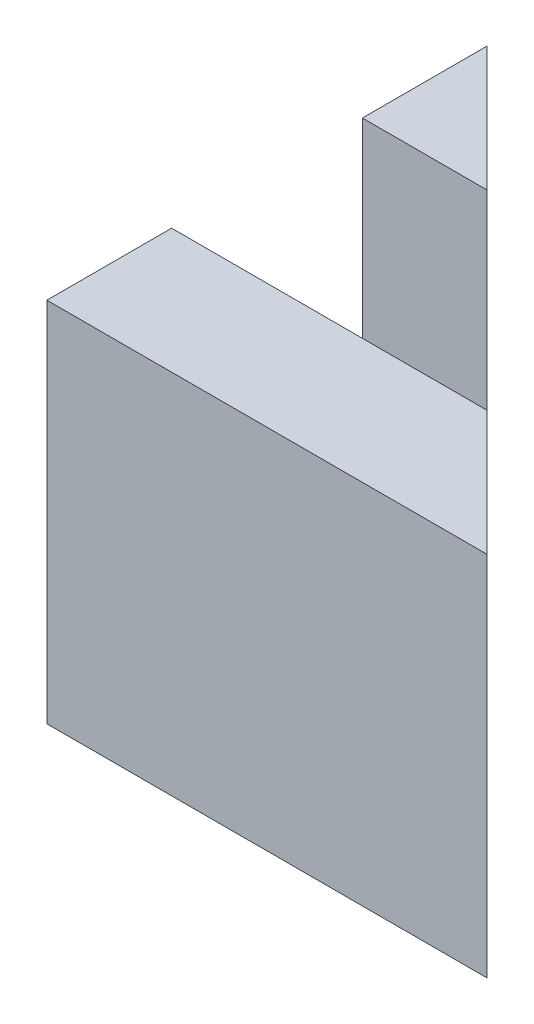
ISO-10303-21;
HEADER;
FILE_DESCRIPTION(('STEP AP214'),'2;1');
FILE_NAME('part.step','',(''),(''),'','','');
FILE_SCHEMA(('AUTOMOTIVE_DESIGN { 1 0 10303 214 1 1 1 1 }'));
ENDSEC;
DATA;
#1=APPLICATION_CONTEXT('core data for automotive mechanical design processes');
#2=APPLICATION_PROTOCOL_DEFINITION('international standard','automotive_design',2000,#1);
#3=PRODUCT_CONTEXT('',#1,'mechanical');
#4=PRODUCT('Part','Part','',(#3));
#5=PRODUCT_RELATED_PRODUCT_CATEGORY('part','',(#4));
#6=PRODUCT_DEFINITION_FORMATION('','',#4);
#7=PRODUCT_DEFINITION_CONTEXT('part definition',#1,'design');
#8=PRODUCT_DEFINITION('design','',#6,#7);
#9=PRODUCT_DEFINITION_SHAPE('','',#8);
#10=(LENGTH_UNIT() NAMED_UNIT(*) SI_UNIT(.MILLI.,.METRE.));
#11=(NAMED_UNIT(*) PLANE_ANGLE_UNIT() SI_UNIT($,.RADIAN.));
#12=(NAMED_UNIT(*) SI_UNIT($,.STERADIAN.) SOLID_ANGLE_UNIT());
#13=UNCERTAINTY_MEASURE_WITH_UNIT(LENGTH_MEASURE(1.E-05),#10,'distance_accuracy_value','');
#14=(GEOMETRIC_REPRESENTATION_CONTEXT(3) GLOBAL_UNCERTAINTY_ASSIGNED_CONTEXT((#13)) GLOBAL_UNIT_ASSIGNED_CONTEXT((#10,
#11,#12)) REPRESENTATION_CONTEXT('',''));
#15=CARTESIAN_POINT('',(0.,0.,0.));
#16=DIRECTION('',(0.,0.,1.));
#17=DIRECTION('',(1.,0.,0.));
#18=AXIS2_PLACEMENT_3D('',#15,#16,#17);
#19=CARTESIAN_POINT('',(0.,9.,-21.5));
#20=DIRECTION('',(-1.,0.,0.));
#21=DIRECTION('',(0.,0.,1.));
#22=AXIS2_PLACEMENT_3D('',#19,#20,#21);
#23=PLANE('',#22);
#24=DIRECTION('',(0.,1.,0.));
#25=VECTOR('',#24,1.);
#26=CARTESIAN_POINT('',(0.,9.,-27.9763480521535));
#27=LINE('',#26,#25);
#28=CARTESIAN_POINT('',(0.,9.52365194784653,-27.9763480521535));
#29=VERTEX_POINT('',#28);
#30=CARTESIAN_POINT('',(0.,15.4763480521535,-27.9763480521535));
#31=VERTEX_POINT('',#30);
#32=EDGE_CURVE('E461',#29,#31,#27,.T.);
#33=ORIENTED_EDGE('',*,*,#32,.T.);
#34=DIRECTION('',(0.,0.,1.));
#35=VECTOR('',#34,1.);
#36=CARTESIAN_POINT('',(0.,15.4763480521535,-21.5));
#37=LINE('',#36,#35);
#38=CARTESIAN_POINT('',(0.,15.4763480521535,-23.5236519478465));
#39=VERTEX_POINT('',#38);
#40=EDGE_CURVE('E444',#31,#39,#37,.T.);
#41=ORIENTED_EDGE('',*,*,#40,.T.);
#42=DIRECTION('',(0.,-1.,0.));
#43=VECTOR('',#42,1.);
#44=CARTESIAN_POINT('',(0.,9.,-23.5236519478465));
#45=LINE('',#44,#43);
#46=CARTESIAN_POINT('',(0.,9.52365194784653,-23.5236519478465));
#47=VERTEX_POINT('',#46);
#48=EDGE_CURVE('E468',#39,#47,#45,.T.);
#49=ORIENTED_EDGE('',*,*,#48,.T.);
#50=DIRECTION('',(0.,0.,-1.));
#51=VECTOR('',#50,1.);
#52=CARTESIAN_POINT('',(0.,9.52365194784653,-21.5));
#53=LINE('',#52,#51);
#54=EDGE_CURVE('E471',#47,#29,#53,.T.);
#55=ORIENTED_EDGE('',*,*,#54,.T.);
#56=EDGE_LOOP('',(#33,#41,#49,#55));
#57=FACE_BOUND('',#56,.T.);
#58=DIRECTION('',(0.,1.,0.));
#59=VECTOR('',#58,1.);
#60=CARTESIAN_POINT('',(0.,9.,-20.9763480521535));
#61=LINE('',#60,#59);
#62=CARTESIAN_POINT('',(0.,2.02365194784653,-20.9763480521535));
#63=VERTEX_POINT('',#62);
#64=CARTESIAN_POINT('',(0.,6.97634805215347,-20.9763480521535));
#65=VERTEX_POINT('',#64);
#66=EDGE_CURVE('E423',#63,#65,#61,.T.);
#67=ORIENTED_EDGE('',*,*,#66,.T.);
#68=DIRECTION('',(0.,0.,1.));
#69=VECTOR('',#68,1.);
#70=CARTESIAN_POINT('',(0.,6.97634805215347,-21.5));
#71=LINE('',#70,#69);
#72=CARTESIAN_POINT('',(0.,6.97634805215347,-16.2736519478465));
#73=VERTEX_POINT('',#72);
#74=EDGE_CURVE('E318',#65,#73,#71,.T.);
#75=ORIENTED_EDGE('',*,*,#74,.T.);
#76=DIRECTION('',(0.,-1.,0.));
#77=VECTOR('',#76,1.);
#78=CARTESIAN_POINT('',(0.,8.99999999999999,-16.2736519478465));
#79=LINE('',#78,#77);
#80=CARTESIAN_POINT('',(0.,2.02365194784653,-16.2736519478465));
#81=VERTEX_POINT('',#80);
#82=EDGE_CURVE('E430',#73,#81,#79,.T.);
#83=ORIENTED_EDGE('',*,*,#82,.T.);
#84=DIRECTION('',(0.,0.,-1.));
#85=VECTOR('',#84,1.);
#86=CARTESIAN_POINT('',(0.,2.02365194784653,-21.5));
#87=LINE('',#86,#85);
#88=EDGE_CURVE('E433',#81,#63,#87,.T.);
#89=ORIENTED_EDGE('',*,*,#88,.T.);
#90=EDGE_LOOP('',(#67,#75,#83,#89));
#91=FACE_BOUND('',#90,.T.);
#92=DIRECTION('',(0.,-1.,0.));
#93=VECTOR('',#92,1.);
#94=CARTESIAN_POINT('',(0.,9.00000000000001,-2.02365194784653));
#95=LINE('',#94,#93);
#96=CARTESIAN_POINT('',(0.,22.9763480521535,-2.02365194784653));
#97=VERTEX_POINT('',#96);
#98=CARTESIAN_POINT('',(0.,18.0236519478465,-2.02365194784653));
#99=VERTEX_POINT('',#98);
#100=EDGE_CURVE('E388',#97,#99,#95,.T.);
#101=ORIENTED_EDGE('',*,*,#100,.T.);
#102=DIRECTION('',(0.,0.,-1.));
#103=VECTOR('',#102,1.);
#104=CARTESIAN_POINT('',(0.,18.0236519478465,-21.5));
#105=LINE('',#104,#103);
#106=CARTESIAN_POINT('',(0.,18.0236519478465,-6.47634805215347));
#107=VERTEX_POINT('',#106);
#108=EDGE_CURVE('E362',#99,#107,#105,.T.);
#109=ORIENTED_EDGE('',*,*,#108,.T.);
#110=DIRECTION('',(0.,1.,0.));
#111=VECTOR('',#110,1.);
#112=CARTESIAN_POINT('',(0.,9.,-6.47634805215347));
#113=LINE('',#112,#111);
#114=CARTESIAN_POINT('',(0.,22.9763480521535,-6.47634805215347));
#115=VERTEX_POINT('',#114);
#116=EDGE_CURVE('E393',#107,#115,#113,.T.);
#117=ORIENTED_EDGE('',*,*,#116,.T.);
#118=DIRECTION('',(0.,0.,1.));
#119=VECTOR('',#118,1.);
#120=CARTESIAN_POINT('',(0.,22.9763480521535,-21.5));
#121=LINE('',#120,#119);
#122=EDGE_CURVE('E390',#115,#97,#121,.T.);
#123=ORIENTED_EDGE('',*,*,#122,.T.);
#124=EDGE_LOOP('',(#101,#109,#117,#123));
#125=FACE_BOUND('',#124,.T.);
#126=DIRECTION('',(0.,0.,1.));
#127=VECTOR('',#126,1.);
#128=CARTESIAN_POINT('',(0.,6.97634805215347,-21.5));
#129=LINE('',#128,#127);
#130=CARTESIAN_POINT('',(0.,6.97634805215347,-13.7263480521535));
#131=VERTEX_POINT('',#130);
#132=CARTESIAN_POINT('',(0.,6.97634805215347,-9.02365194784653));
#133=VERTEX_POINT('',#132);
#134=EDGE_CURVE('E405',#131,#133,#129,.T.);
#135=ORIENTED_EDGE('',*,*,#134,.T.);
#136=DIRECTION('',(0.,-1.,0.));
#137=VECTOR('',#136,1.);
#138=CARTESIAN_POINT('',(0.,9.,-9.02365194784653));
#139=LINE('',#138,#137);
#140=CARTESIAN_POINT('',(0.,2.02365194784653,-9.02365194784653));
#141=VERTEX_POINT('',#140);
#142=EDGE_CURVE('E346',#133,#141,#139,.T.);
#143=ORIENTED_EDGE('',*,*,#142,.T.);
#144=DIRECTION('',(0.,0.,-1.));
#145=VECTOR('',#144,1.);
#146=CARTESIAN_POINT('',(0.,2.02365194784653,-21.5));
#147=LINE('',#146,#145);
#148=CARTESIAN_POINT('',(0.,2.02365194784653,-13.7263480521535));
#149=VERTEX_POINT('',#148);
#150=EDGE_CURVE('E415',#141,#149,#147,.T.);
#151=ORIENTED_EDGE('',*,*,#150,.T.);
#152=DIRECTION('',(0.,1.,0.));
#153=VECTOR('',#152,1.);
#154=CARTESIAN_POINT('',(0.,9.,-13.7263480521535));
#155=LINE('',#154,#153);
#156=EDGE_CURVE('E412',#149,#131,#155,.T.);
#157=ORIENTED_EDGE('',*,*,#156,.T.);
#158=EDGE_LOOP('',(#135,#143,#151,#157));
#159=FACE_BOUND('',#158,.T.);
#160=DIRECTION('',(0.,-1.,0.));
#161=VECTOR('',#160,1.);
#162=CARTESIAN_POINT('',(0.,9.,-21.5));
#163=LINE('',#162,#161);
#164=CARTESIAN_POINT('',(0.,25.,-21.5));
#165=VERTEX_POINT('',#164);
#166=CARTESIAN_POINT('',(0.,9.,-21.5));
#167=VERTEX_POINT('',#166);
#168=EDGE_CURVE('E408',#165,#167,#163,.T.);
#169=ORIENTED_EDGE('',*,*,#168,.F.);
#170=DIRECTION('',(0.,0.,1.));
#171=VECTOR('',#170,1.);
#172=CARTESIAN_POINT('',(0.,25.,-21.5));
#173=LINE('',#172,#171);
#174=CARTESIAN_POINT('',(0.,25.,-30.));
#175=VERTEX_POINT('',#174);
#176=EDGE_CURVE('E298',#175,#165,#173,.T.);
#177=ORIENTED_EDGE('',*,*,#176,.F.);
#178=DIRECTION('',(0.,1.,0.));
#179=VECTOR('',#178,1.);
#180=CARTESIAN_POINT('',(0.,25.,-30.));
#181=LINE('',#180,#179);
#182=CARTESIAN_POINT('',(0.,0.,-30.));
#183=VERTEX_POINT('',#182);
#184=EDGE_CURVE('E281',#183,#175,#181,.T.);
#185=ORIENTED_EDGE('',*,*,#184,.F.);
#186=DIRECTION('',(0.,0.,-1.));
#187=VECTOR('',#186,1.);
#188=CARTESIAN_POINT('',(0.,0.,0.));
#189=LINE('',#188,#187);
#190=CARTESIAN_POINT('',(0.,0.,0.));
#191=VERTEX_POINT('',#190);
#192=EDGE_CURVE('E569',#191,#183,#189,.T.);
#193=ORIENTED_EDGE('',*,*,#192,.F.);
#194=DIRECTION('',(0.,-1.,0.));
#195=VECTOR('',#194,1.);
#196=CARTESIAN_POINT('',(0.,25.,0.));
#197=LINE('',#196,#195);
#198=CARTESIAN_POINT('',(0.,25.,0.));
#199=VERTEX_POINT('',#198);
#200=EDGE_CURVE('E567',#199,#191,#197,.T.);
#201=ORIENTED_EDGE('',*,*,#200,.F.);
#202=DIRECTION('',(0.,0.,1.));
#203=VECTOR('',#202,1.);
#204=CARTESIAN_POINT('',(0.,25.,-8.5));
#205=LINE('',#204,#203);
#206=CARTESIAN_POINT('',(0.,25.,-8.5));
#207=VERTEX_POINT('',#206);
#208=EDGE_CURVE('E565',#207,#199,#205,.T.);
#209=ORIENTED_EDGE('',*,*,#208,.F.);
#210=DIRECTION('',(0.,1.,0.));
#211=VECTOR('',#210,1.);
#212=CARTESIAN_POINT('',(0.,9.,-8.5));
#213=LINE('',#212,#211);
#214=CARTESIAN_POINT('',(0.,9.,-8.5));
#215=VERTEX_POINT('',#214);
#216=EDGE_CURVE('E562',#215,#207,#213,.T.);
#217=ORIENTED_EDGE('',*,*,#216,.F.);
#218=DIRECTION('',(0.,0.,1.));
#219=VECTOR('',#218,1.);
#220=CARTESIAN_POINT('',(0.,9.,-8.5));
#221=LINE('',#220,#219);
#222=EDGE_CURVE('E559',#167,#215,#221,.T.);
#223=ORIENTED_EDGE('',*,*,#222,.F.);
#224=EDGE_LOOP('',(#169,#177,#185,#193,#201,#209,#217,#223));
#225=FACE_BOUND('',#224,.T.);
#226=DIRECTION('',(0.,0.,1.));
#227=VECTOR('',#226,1.);
#228=CARTESIAN_POINT('',(0.,6.97634805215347,-21.5));
#229=LINE('',#228,#227);
#230=CARTESIAN_POINT('',(0.,6.97634805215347,-6.47634805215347));
#231=VERTEX_POINT('',#230);
#232=CARTESIAN_POINT('',(0.,6.97634805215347,-2.02365194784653));
#233=VERTEX_POINT('',#232);
#234=EDGE_CURVE('E343',#231,#233,#229,.T.);
#235=ORIENTED_EDGE('',*,*,#234,.T.);
#236=DIRECTION('',(0.,-1.,0.));
#237=VECTOR('',#236,1.);
#238=CARTESIAN_POINT('',(0.,9.,-2.02365194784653));
#239=LINE('',#238,#237);
#240=CARTESIAN_POINT('',(0.,2.02365194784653,-2.02365194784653));
#241=VERTEX_POINT('',#240);
#242=EDGE_CURVE('E351',#233,#241,#239,.T.);
#243=ORIENTED_EDGE('',*,*,#242,.T.);
#244=DIRECTION('',(0.,0.,-1.));
#245=VECTOR('',#244,1.);
#246=CARTESIAN_POINT('',(0.,2.02365194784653,-21.5));
#247=LINE('',#246,#245);
#248=CARTESIAN_POINT('',(0.,2.02365194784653,-6.47634805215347));
#249=VERTEX_POINT('',#248);
#250=EDGE_CURVE('E354',#241,#249,#247,.T.);
#251=ORIENTED_EDGE('',*,*,#250,.T.);
#252=DIRECTION('',(0.,1.,0.));
#253=VECTOR('',#252,1.);
#254=CARTESIAN_POINT('',(0.,9.,-6.47634805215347));
#255=LINE('',#254,#253);
#256=EDGE_CURVE('E350',#249,#231,#255,.T.);
#257=ORIENTED_EDGE('',*,*,#256,.T.);
#258=EDGE_LOOP('',(#235,#243,#251,#257));
#259=FACE_BOUND('',#258,.T.);
#260=DIRECTION('',(0.,0.,-1.));
#261=VECTOR('',#260,1.);
#262=CARTESIAN_POINT('',(0.,9.52365194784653,-21.5));
#263=LINE('',#262,#261);
#264=CARTESIAN_POINT('',(0.,9.52365194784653,-2.02365194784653));
#265=VERTEX_POINT('',#264);
#266=CARTESIAN_POINT('',(0.,9.52365194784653,-6.47634805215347));
#267=VERTEX_POINT('',#266);
#268=EDGE_CURVE('E369',#265,#267,#263,.T.);
#269=ORIENTED_EDGE('',*,*,#268,.T.);
#270=DIRECTION('',(0.,1.,0.));
#271=VECTOR('',#270,1.);
#272=CARTESIAN_POINT('',(0.,9.,-6.47634805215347));
#273=LINE('',#272,#271);
#274=CARTESIAN_POINT('',(0.,15.4763480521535,-6.47634805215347));
#275=VERTEX_POINT('',#274);
#276=EDGE_CURVE('E374',#267,#275,#273,.T.);
#277=ORIENTED_EDGE('',*,*,#276,.T.);
#278=DIRECTION('',(0.,0.,1.));
#279=VECTOR('',#278,1.);
#280=CARTESIAN_POINT('',(0.,15.4763480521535,-21.5));
#281=LINE('',#280,#279);
#282=CARTESIAN_POINT('',(0.,15.4763480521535,-2.02365194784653));
#283=VERTEX_POINT('',#282);
#284=EDGE_CURVE('E370',#275,#283,#281,.T.);
#285=ORIENTED_EDGE('',*,*,#284,.T.);
#286=DIRECTION('',(0.,-1.,0.));
#287=VECTOR('',#286,1.);
#288=CARTESIAN_POINT('',(0.,9.,-2.02365194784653));
#289=LINE('',#288,#287);
#290=EDGE_CURVE('E373',#283,#265,#289,.T.);
#291=ORIENTED_EDGE('',*,*,#290,.T.);
#292=EDGE_LOOP('',(#269,#277,#285,#291));
#293=FACE_BOUND('',#292,.T.);
#294=DIRECTION('',(0.,0.,-1.));
#295=VECTOR('',#294,1.);
#296=CARTESIAN_POINT('',(0.,18.0236519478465,-21.5));
#297=LINE('',#296,#295);
#298=CARTESIAN_POINT('',(0.,18.0236519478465,-23.5236519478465));
#299=VERTEX_POINT('',#298);
#300=CARTESIAN_POINT('',(0.,18.0236519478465,-27.9763480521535));
#301=VERTEX_POINT('',#300);
#302=EDGE_CURVE('E325',#299,#301,#297,.T.);
#303=ORIENTED_EDGE('',*,*,#302,.T.);
#304=DIRECTION('',(0.,1.,0.));
#305=VECTOR('',#304,1.);
#306=CARTESIAN_POINT('',(0.,8.99999999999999,-27.9763480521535));
#307=LINE('',#306,#305);
#308=CARTESIAN_POINT('',(0.,22.9763480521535,-27.9763480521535));
#309=VERTEX_POINT('',#308);
#310=EDGE_CURVE('E330',#301,#309,#307,.T.);
#311=ORIENTED_EDGE('',*,*,#310,.T.);
#312=DIRECTION('',(0.,0.,1.));
#313=VECTOR('',#312,1.);
#314=CARTESIAN_POINT('',(0.,22.9763480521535,-21.5));
#315=LINE('',#314,#313);
#316=CARTESIAN_POINT('',(0.,22.9763480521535,-23.5236519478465));
#317=VERTEX_POINT('',#316);
#318=EDGE_CURVE('E326',#309,#317,#315,.T.);
#319=ORIENTED_EDGE('',*,*,#318,.T.);
#320=DIRECTION('',(0.,-1.,0.));
#321=VECTOR('',#320,1.);
#322=CARTESIAN_POINT('',(0.,9.,-23.5236519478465));
#323=LINE('',#322,#321);
#324=EDGE_CURVE('E329',#317,#299,#323,.T.);
#325=ORIENTED_EDGE('',*,*,#324,.T.);
#326=EDGE_LOOP('',(#303,#311,#319,#325));
#327=FACE_BOUND('',#326,.T.);
#328=DIRECTION('',(0.,1.,0.));
#329=VECTOR('',#328,1.);
#330=CARTESIAN_POINT('',(0.,9.00000000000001,-27.9763480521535));
#331=LINE('',#330,#329);
#332=CARTESIAN_POINT('',(0.,2.02365194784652,-27.9763480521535));
#333=VERTEX_POINT('',#332);
#334=CARTESIAN_POINT('',(0.,6.97634805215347,-27.9763480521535));
#335=VERTEX_POINT('',#334);
#336=EDGE_CURVE('E441',#333,#335,#331,.T.);
#337=ORIENTED_EDGE('',*,*,#336,.T.);
#338=DIRECTION('',(0.,0.,1.));
#339=VECTOR('',#338,1.);
#340=CARTESIAN_POINT('',(0.,6.97634805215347,-21.5));
#341=LINE('',#340,#339);
#342=CARTESIAN_POINT('',(0.,6.97634805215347,-23.5236519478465));
#343=VERTEX_POINT('',#342);
#344=EDGE_CURVE('E294',#335,#343,#341,.T.);
#345=ORIENTED_EDGE('',*,*,#344,.T.);
#346=DIRECTION('',(0.,-1.,0.));
#347=VECTOR('',#346,1.);
#348=CARTESIAN_POINT('',(0.,9.,-23.5236519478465));
#349=LINE('',#348,#347);
#350=CARTESIAN_POINT('',(0.,2.02365194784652,-23.5236519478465));
#351=VERTEX_POINT('',#350);
#352=EDGE_CURVE('E450',#343,#351,#349,.T.);
#353=ORIENTED_EDGE('',*,*,#352,.T.);
#354=DIRECTION('',(0.,0.,-1.));
#355=VECTOR('',#354,1.);
#356=CARTESIAN_POINT('',(0.,2.02365194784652,-21.5));
#357=LINE('',#356,#355);
#358=EDGE_CURVE('E453',#351,#333,#357,.T.);
#359=ORIENTED_EDGE('',*,*,#358,.T.);
#360=EDGE_LOOP('',(#337,#345,#353,#359));
#361=FACE_BOUND('',#360,.T.);
#362=ADVANCED_FACE('F26',(#57,#91,#125,#159,#225,#259,#293,#327,#361),#23,.T.);
#363=CARTESIAN_POINT('',(30.,9.,-21.5));
#364=DIRECTION('',(0.,0.,-1.));
#365=DIRECTION('',(0.,1.,0.));
#366=AXIS2_PLACEMENT_3D('',#363,#364,#365);
#367=PLANE('',#366);
#368=DIRECTION('',(-1.,0.,0.));
#369=VECTOR('',#368,1.);
#370=CARTESIAN_POINT('',(30.,9.,-21.5));
#371=LINE('',#370,#369);
#372=CARTESIAN_POINT('',(8.50000000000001,9.,-21.5));
#373=VERTEX_POINT('',#372);
#374=EDGE_CURVE('E34',#373,#167,#371,.T.);
#375=ORIENTED_EDGE('',*,*,#374,.F.);
#376=DIRECTION('',(0.,1.,0.));
#377=VECTOR('',#376,1.);
#378=CARTESIAN_POINT('',(8.50000000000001,9.,-21.5));
#379=LINE('',#378,#377);
#380=CARTESIAN_POINT('',(8.50000000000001,25.,-21.5));
#381=VERTEX_POINT('',#380);
#382=EDGE_CURVE('E278',#373,#381,#379,.T.);
#383=ORIENTED_EDGE('',*,*,#382,.T.);
#384=DIRECTION('',(-1.,0.,0.));
#385=VECTOR('',#384,1.);
#386=CARTESIAN_POINT('',(30.,25.,-21.5));
#387=LINE('',#386,#385);
#388=EDGE_CURVE('E293',#381,#165,#387,.T.);
#389=ORIENTED_EDGE('',*,*,#388,.T.);
#390=ORIENTED_EDGE('',*,*,#168,.T.);
#391=EDGE_LOOP('',(#375,#383,#389,#390));
#392=FACE_BOUND('',#391,.T.);
#393=ADVANCED_FACE('F291',(#392),#367,.F.);
#394=CARTESIAN_POINT('',(30.,9.,-8.5));
#395=DIRECTION('',(0.,-1.,0.));
#396=DIRECTION('',(0.,0.,-1.));
#397=AXIS2_PLACEMENT_3D('',#394,#395,#396);
#398=PLANE('',#397);
#399=DIRECTION('',(-1.,0.,0.));
#400=VECTOR('',#399,1.);
#401=CARTESIAN_POINT('',(30.,9.,-8.5));
#402=LINE('',#401,#400);
#403=CARTESIAN_POINT('',(21.5,9.,-8.5));
#404=VERTEX_POINT('',#403);
#405=EDGE_CURVE('E313',#404,#215,#402,.T.);
#406=ORIENTED_EDGE('',*,*,#405,.F.);
#407=DIRECTION('',(-0.707106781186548,0.,-0.707106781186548));
#408=VECTOR('',#407,1.);
#409=CARTESIAN_POINT('',(25.75,9.,-4.25000000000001));
#410=LINE('',#409,#408);
#411=EDGE_CURVE('E295',#404,#373,#410,.T.);
#412=ORIENTED_EDGE('',*,*,#411,.T.);
#413=ORIENTED_EDGE('',*,*,#374,.T.);
#414=ORIENTED_EDGE('',*,*,#222,.T.);
#415=EDGE_LOOP('',(#406,#412,#413,#414));
#416=FACE_BOUND('',#415,.T.);
#417=ADVANCED_FACE('F585',(#416),#398,.F.);
#418=CARTESIAN_POINT('',(30.,9.,-8.5));
#419=DIRECTION('',(0.,0.,1.));
#420=DIRECTION('',(1.,0.,0.));
#421=AXIS2_PLACEMENT_3D('',#418,#419,#420);
#422=PLANE('',#421);
#423=DIRECTION('',(-1.,0.,0.));
#424=VECTOR('',#423,1.);
#425=CARTESIAN_POINT('',(30.,25.,-8.5));
#426=LINE('',#425,#424);
#427=CARTESIAN_POINT('',(21.5,25.,-8.50000000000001));
#428=VERTEX_POINT('',#427);
#429=EDGE_CURVE('E311',#428,#207,#426,.T.);
#430=ORIENTED_EDGE('',*,*,#429,.F.);
#431=DIRECTION('',(0.,-1.,0.));
#432=VECTOR('',#431,1.);
#433=CARTESIAN_POINT('',(21.5,9.,-8.5));
#434=LINE('',#433,#432);
#435=EDGE_CURVE('E554',#428,#404,#434,.T.);
#436=ORIENTED_EDGE('',*,*,#435,.T.);
#437=ORIENTED_EDGE('',*,*,#405,.T.);
#438=ORIENTED_EDGE('',*,*,#216,.T.);
#439=EDGE_LOOP('',(#430,#436,#437,#438));
#440=FACE_BOUND('',#439,.T.);
#441=ADVANCED_FACE('F589',(#440),#422,.F.);
#442=CARTESIAN_POINT('',(30.,25.,-8.5));
#443=DIRECTION('',(0.,-1.,0.));
#444=DIRECTION('',(0.,0.,-1.));
#445=AXIS2_PLACEMENT_3D('',#442,#443,#444);
#446=PLANE('',#445);
#447=DIRECTION('',(-1.,0.,0.));
#448=VECTOR('',#447,1.);
#449=CARTESIAN_POINT('',(30.,25.,0.));
#450=LINE('',#449,#448);
#451=CARTESIAN_POINT('',(30.,25.,0.));
#452=VERTEX_POINT('',#451);
#453=EDGE_CURVE('E304',#452,#199,#450,.T.);
#454=ORIENTED_EDGE('',*,*,#453,.F.);
#455=DIRECTION('',(0.707106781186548,0.,0.707106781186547));
#456=VECTOR('',#455,1.);
#457=CARTESIAN_POINT('',(-1.37798348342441,25.,-31.3779834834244));
#458=LINE('',#457,#456);
#459=EDGE_CURVE('E287',#428,#452,#458,.T.);
#460=ORIENTED_EDGE('',*,*,#459,.F.);
#461=ORIENTED_EDGE('',*,*,#429,.T.);
#462=ORIENTED_EDGE('',*,*,#208,.T.);
#463=EDGE_LOOP('',(#454,#460,#461,#462));
#464=FACE_BOUND('',#463,.T.);
#465=ADVANCED_FACE('F592',(#464),#446,.F.);
#466=CARTESIAN_POINT('',(30.,25.,0.));
#467=DIRECTION('',(0.,0.,-1.));
#468=DIRECTION('',(-1.,0.,0.));
#469=AXIS2_PLACEMENT_3D('',#466,#467,#468);
#470=PLANE('',#469);
#471=ORIENTED_EDGE('',*,*,#200,.T.);
#472=DIRECTION('',(-1.,0.,0.));
#473=VECTOR('',#472,1.);
#474=CARTESIAN_POINT('',(30.,0.,0.));
#475=LINE('',#474,#473);
#476=CARTESIAN_POINT('',(30.,0.,0.));
#477=VERTEX_POINT('',#476);
#478=EDGE_CURVE('E300',#477,#191,#475,.T.);
#479=ORIENTED_EDGE('',*,*,#478,.F.);
#480=DIRECTION('',(0.,-1.,0.));
#481=VECTOR('',#480,1.);
#482=CARTESIAN_POINT('',(30.,25.,0.));
#483=LINE('',#482,#481);
#484=EDGE_CURVE('E301',#452,#477,#483,.T.);
#485=ORIENTED_EDGE('',*,*,#484,.F.);
#486=ORIENTED_EDGE('',*,*,#453,.T.);
#487=EDGE_LOOP('',(#471,#479,#485,#486));
#488=FACE_BOUND('',#487,.T.);
#489=ADVANCED_FACE('F643',(#488),#470,.F.);
#490=CARTESIAN_POINT('',(30.,0.,0.));
#491=DIRECTION('',(0.,1.,0.));
#492=DIRECTION('',(0.,0.,1.));
#493=AXIS2_PLACEMENT_3D('',#490,#491,#492);
#494=PLANE('',#493);
#495=ORIENTED_EDGE('',*,*,#192,.T.);
#496=DIRECTION('',(0.707106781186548,0.,0.707106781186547));
#497=VECTOR('',#496,1.);
#498=CARTESIAN_POINT('',(-1.37798348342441,0.,-31.3779834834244));
#499=LINE('',#498,#497);
#500=EDGE_CURVE('E286',#183,#477,#499,.T.);
#501=ORIENTED_EDGE('',*,*,#500,.T.);
#502=ORIENTED_EDGE('',*,*,#478,.T.);
#503=EDGE_LOOP('',(#495,#501,#502));
#504=FACE_BOUND('',#503,.T.);
#505=ADVANCED_FACE('F575',(#504),#494,.F.);
#506=CARTESIAN_POINT('',(30.,25.,-21.5));
#507=DIRECTION('',(0.,-1.,0.));
#508=DIRECTION('',(0.,0.,-1.));
#509=AXIS2_PLACEMENT_3D('',#506,#507,#508);
#510=PLANE('',#509);
#511=ORIENTED_EDGE('',*,*,#388,.F.);
#512=EDGE_CURVE('E275',#175,#381,#458,.T.);
#513=ORIENTED_EDGE('',*,*,#512,.F.);
#514=ORIENTED_EDGE('',*,*,#176,.T.);
#515=EDGE_LOOP('',(#511,#513,#514));
#516=FACE_BOUND('',#515,.T.);
#517=ADVANCED_FACE('F297',(#516),#510,.F.);
#518=CARTESIAN_POINT('',(30.,7.5,-8.5));
#519=DIRECTION('',(0.0174524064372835,0.,-0.999847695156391));
#520=DIRECTION('',(-0.999847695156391,0.,-0.0174524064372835));
#521=AXIS2_PLACEMENT_3D('',#518,#519,#520);
#522=PLANE('',#521);
#523=DIRECTION('',(0.,1.,0.));
#524=VECTOR('',#523,1.);
#525=CARTESIAN_POINT('',(21.3489961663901,7.5,-8.65100383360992));
#526=LINE('',#525,#524);
#527=CARTESIAN_POINT('',(21.3489961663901,1.65100383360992,-8.65100383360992));
#528=VERTEX_POINT('',#527);
#529=CARTESIAN_POINT('',(21.3489961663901,7.34899616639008,-8.65100383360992));
#530=VERTEX_POINT('',#529);
#531=EDGE_CURVE('E41',#528,#530,#526,.T.);
#532=ORIENTED_EDGE('',*,*,#531,.F.);
#533=DIRECTION('',(-0.999695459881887,0.0174497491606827,-0.0174497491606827));
#534=VECTOR('',#533,1.);
#535=CARTESIAN_POINT('',(30.,1.5,-8.5));
#536=LINE('',#535,#534);
#537=EDGE_CURVE('E406',#528,#141,#536,.T.);
#538=ORIENTED_EDGE('',*,*,#537,.T.);
#539=ORIENTED_EDGE('',*,*,#142,.F.);
#540=DIRECTION('',(-0.999695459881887,-0.0174497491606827,-0.0174497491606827));
#541=VECTOR('',#540,1.);
#542=CARTESIAN_POINT('',(30.,7.5,-8.5));
#543=LINE('',#542,#541);
#544=EDGE_CURVE('E403',#530,#133,#543,.T.);
#545=ORIENTED_EDGE('',*,*,#544,.F.);
#546=EDGE_LOOP('',(#532,#538,#539,#545));
#547=FACE_BOUND('',#546,.T.);
#548=ADVANCED_FACE('F640',(#547),#522,.T.);
#549=CARTESIAN_POINT('',(30.,1.5,-8.5));
#550=DIRECTION('',(0.0174524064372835,0.999847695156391,0.));
#551=DIRECTION('',(-0.999847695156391,0.0174524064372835,0.));
#552=AXIS2_PLACEMENT_3D('',#549,#550,#551);
#553=PLANE('',#552);
#554=DIRECTION('',(0.707052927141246,-0.0123416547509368,0.707052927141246));
#555=VECTOR('',#554,1.);
#556=CARTESIAN_POINT('',(25.7506473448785,1.57417272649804,-4.24935265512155));
#557=LINE('',#556,#555);
#558=CARTESIAN_POINT('',(15.9944674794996,1.7444674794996,-14.0055325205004));
#559=VERTEX_POINT('',#558);
#560=EDGE_CURVE('E551',#559,#528,#557,.T.);
#561=ORIENTED_EDGE('',*,*,#560,.F.);
#562=DIRECTION('',(-0.999695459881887,0.0174497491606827,0.0174497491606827));
#563=VECTOR('',#562,1.);
#564=CARTESIAN_POINT('',(29.8953333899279,1.50182696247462,-14.2481730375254));
#565=LINE('',#564,#563);
#566=EDGE_CURVE('E402',#559,#149,#565,.T.);
#567=ORIENTED_EDGE('',*,*,#566,.T.);
#568=ORIENTED_EDGE('',*,*,#150,.F.);
#569=ORIENTED_EDGE('',*,*,#537,.F.);
#570=EDGE_LOOP('',(#561,#567,#568,#569));
#571=FACE_BOUND('',#570,.T.);
#572=ADVANCED_FACE('F691',(#571),#553,.T.);
#573=CARTESIAN_POINT('',(30.,7.5,-14.25));
#574=DIRECTION('',(0.0174524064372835,0.,0.999847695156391));
#575=DIRECTION('',(0.999847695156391,0.,-0.0174524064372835));
#576=AXIS2_PLACEMENT_3D('',#573,#574,#575);
#577=PLANE('',#576);
#578=DIRECTION('',(0.,-1.,0.));
#579=VECTOR('',#578,1.);
#580=CARTESIAN_POINT('',(15.9944674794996,7.49999999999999,-14.0055325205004));
#581=LINE('',#580,#579);
#582=CARTESIAN_POINT('',(15.9944674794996,7.2555325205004,-14.0055325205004));
#583=VERTEX_POINT('',#582);
#584=EDGE_CURVE('E549',#583,#559,#581,.T.);
#585=ORIENTED_EDGE('',*,*,#584,.F.);
#586=DIRECTION('',(-0.999695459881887,-0.0174497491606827,0.0174497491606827));
#587=VECTOR('',#586,1.);
#588=CARTESIAN_POINT('',(29.8996944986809,7.49824916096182,-14.2482491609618));
#589=LINE('',#588,#587);
#590=EDGE_CURVE('E400',#583,#131,#589,.T.);
#591=ORIENTED_EDGE('',*,*,#590,.T.);
#592=ORIENTED_EDGE('',*,*,#156,.F.);
#593=ORIENTED_EDGE('',*,*,#566,.F.);
#594=EDGE_LOOP('',(#585,#591,#592,#593));
#595=FACE_BOUND('',#594,.T.);
#596=ADVANCED_FACE('F687',(#595),#577,.T.);
#597=CARTESIAN_POINT('',(30.,7.5,-8.5));
#598=DIRECTION('',(0.0174524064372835,-0.999847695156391,0.));
#599=DIRECTION('',(0.999847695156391,0.0174524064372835,0.));
#600=AXIS2_PLACEMENT_3D('',#597,#598,#599);
#601=PLANE('',#600);
#602=DIRECTION('',(-0.707052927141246,-0.0123416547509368,-0.707052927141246));
#603=VECTOR('',#602,1.);
#604=CARTESIAN_POINT('',(25.7506473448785,7.42582727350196,-4.24935265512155));
#605=LINE('',#604,#603);
#606=EDGE_CURVE('E547',#530,#583,#605,.T.);
#607=ORIENTED_EDGE('',*,*,#606,.F.);
#608=ORIENTED_EDGE('',*,*,#544,.T.);
#609=ORIENTED_EDGE('',*,*,#134,.F.);
#610=ORIENTED_EDGE('',*,*,#590,.F.);
#611=EDGE_LOOP('',(#607,#608,#609,#610));
#612=FACE_BOUND('',#611,.T.);
#613=ADVANCED_FACE('F690',(#612),#601,.T.);
#614=CARTESIAN_POINT('',(30.,7.5,-1.5));
#615=DIRECTION('',(0.0174524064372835,0.,-0.999847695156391));
#616=DIRECTION('',(-0.999847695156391,0.,-0.0174524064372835));
#617=AXIS2_PLACEMENT_3D('',#614,#615,#616);
#618=PLANE('',#617);
#619=DIRECTION('',(0.,1.,0.));
#620=VECTOR('',#619,1.);
#621=CARTESIAN_POINT('',(28.4733522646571,7.5,-1.52664773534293));
#622=LINE('',#621,#620);
#623=CARTESIAN_POINT('',(28.4733522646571,1.52664773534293,-1.52664773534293));
#624=VERTEX_POINT('',#623);
#625=CARTESIAN_POINT('',(28.4733522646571,7.47335226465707,-1.52664773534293));
#626=VERTEX_POINT('',#625);
#627=EDGE_CURVE('E49',#624,#626,#622,.T.);
#628=ORIENTED_EDGE('',*,*,#627,.F.);
#629=DIRECTION('',(-0.999695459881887,0.0174497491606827,-0.0174497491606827));
#630=VECTOR('',#629,1.);
#631=CARTESIAN_POINT('',(30.,1.5,-1.5));
#632=LINE('',#631,#630);
#633=EDGE_CURVE('E344',#624,#241,#632,.T.);
#634=ORIENTED_EDGE('',*,*,#633,.T.);
#635=ORIENTED_EDGE('',*,*,#242,.F.);
#636=DIRECTION('',(-0.999695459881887,-0.0174497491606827,-0.0174497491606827));
#637=VECTOR('',#636,1.);
#638=CARTESIAN_POINT('',(30.,7.5,-1.5));
#639=LINE('',#638,#637);
#640=EDGE_CURVE('E341',#626,#233,#639,.T.);
#641=ORIENTED_EDGE('',*,*,#640,.F.);
#642=EDGE_LOOP('',(#628,#634,#635,#641));
#643=FACE_BOUND('',#642,.T.);
#644=ADVANCED_FACE('F704',(#643),#618,.T.);
#645=CARTESIAN_POINT('',(30.,1.5,-1.5));
#646=DIRECTION('',(0.0174524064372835,0.999847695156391,0.));
#647=DIRECTION('',(-0.999847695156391,0.0174524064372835,0.));
#648=AXIS2_PLACEMENT_3D('',#645,#646,#647);
#649=PLANE('',#648);
#650=DIRECTION('',(0.707052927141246,-0.0123416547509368,0.707052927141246));
#651=VECTOR('',#650,1.);
#652=CARTESIAN_POINT('',(29.2501142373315,1.51308930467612,-0.749885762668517));
#653=LINE('',#652,#651);
#654=CARTESIAN_POINT('',(23.1200892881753,1.62008928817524,-6.87991071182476));
#655=VERTEX_POINT('',#654);
#656=EDGE_CURVE('E544',#655,#624,#653,.T.);
#657=ORIENTED_EDGE('',*,*,#656,.F.);
#658=DIRECTION('',(-0.999695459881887,0.0174497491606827,0.0174497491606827));
#659=VECTOR('',#658,1.);
#660=CARTESIAN_POINT('',(29.8953333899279,1.50182696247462,-6.99817303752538));
#661=LINE('',#660,#659);
#662=EDGE_CURVE('E340',#655,#249,#661,.T.);
#663=ORIENTED_EDGE('',*,*,#662,.T.);
#664=ORIENTED_EDGE('',*,*,#250,.F.);
#665=ORIENTED_EDGE('',*,*,#633,.F.);
#666=EDGE_LOOP('',(#657,#663,#664,#665));
#667=FACE_BOUND('',#666,.T.);
#668=ADVANCED_FACE('F700',(#667),#649,.T.);
#669=CARTESIAN_POINT('',(30.,7.5,-7.));
#670=DIRECTION('',(0.0174524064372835,0.,0.999847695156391));
#671=DIRECTION('',(0.999847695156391,0.,-0.0174524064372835));
#672=AXIS2_PLACEMENT_3D('',#669,#670,#671);
#673=PLANE('',#672);
#674=DIRECTION('',(0.,-1.,0.));
#675=VECTOR('',#674,1.);
#676=CARTESIAN_POINT('',(23.1200892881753,7.5,-6.87991071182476));
#677=LINE('',#676,#675);
#678=CARTESIAN_POINT('',(23.1200892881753,7.37991071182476,-6.87991071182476));
#679=VERTEX_POINT('',#678);
#680=EDGE_CURVE('E542',#679,#655,#677,.T.);
#681=ORIENTED_EDGE('',*,*,#680,.F.);
#682=DIRECTION('',(-0.999695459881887,-0.0174497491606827,0.0174497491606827));
#683=VECTOR('',#682,1.);
#684=CARTESIAN_POINT('',(29.9040556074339,7.49832528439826,-6.99832528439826));
#685=LINE('',#684,#683);
#686=EDGE_CURVE('E338',#679,#231,#685,.T.);
#687=ORIENTED_EDGE('',*,*,#686,.T.);
#688=ORIENTED_EDGE('',*,*,#256,.F.);
#689=ORIENTED_EDGE('',*,*,#662,.F.);
#690=EDGE_LOOP('',(#681,#687,#688,#689));
#691=FACE_BOUND('',#690,.T.);
#692=ADVANCED_FACE('F696',(#691),#673,.T.);
#693=CARTESIAN_POINT('',(30.,7.5,-1.5));
#694=DIRECTION('',(0.0174524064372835,-0.999847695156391,0.));
#695=DIRECTION('',(0.999847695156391,0.0174524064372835,0.));
#696=AXIS2_PLACEMENT_3D('',#693,#694,#695);
#697=PLANE('',#696);
#698=DIRECTION('',(-0.707052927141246,-0.0123416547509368,-0.707052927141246));
#699=VECTOR('',#698,1.);
#700=CARTESIAN_POINT('',(29.2501142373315,7.48691069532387,-0.749885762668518));
#701=LINE('',#700,#699);
#702=EDGE_CURVE('E540',#626,#679,#701,.T.);
#703=ORIENTED_EDGE('',*,*,#702,.F.);
#704=ORIENTED_EDGE('',*,*,#640,.T.);
#705=ORIENTED_EDGE('',*,*,#234,.F.);
#706=ORIENTED_EDGE('',*,*,#686,.F.);
#707=EDGE_LOOP('',(#703,#704,#705,#706));
#708=FACE_BOUND('',#707,.T.);
#709=ADVANCED_FACE('F699',(#708),#697,.T.);
#710=CARTESIAN_POINT('',(30.,17.5,-1.5));
#711=DIRECTION('',(0.0174524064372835,0.999847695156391,0.));
#712=DIRECTION('',(-0.999847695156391,0.0174524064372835,0.));
#713=AXIS2_PLACEMENT_3D('',#710,#711,#712);
#714=PLANE('',#713);
#715=DIRECTION('',(0.707052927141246,-0.0123416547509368,0.707052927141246));
#716=VECTOR('',#715,1.);
#717=CARTESIAN_POINT('',(29.2501142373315,17.5130893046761,-0.749885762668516));
#718=LINE('',#717,#716);
#719=CARTESIAN_POINT('',(23.1200892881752,17.6200892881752,-6.87991071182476));
#720=VERTEX_POINT('',#719);
#721=CARTESIAN_POINT('',(28.4733522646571,17.5266477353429,-1.52664773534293));
#722=VERTEX_POINT('',#721);
#723=EDGE_CURVE('E538',#720,#722,#718,.T.);
#724=ORIENTED_EDGE('',*,*,#723,.F.);
#725=DIRECTION('',(-0.999695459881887,0.0174497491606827,0.0174497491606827));
#726=VECTOR('',#725,1.);
#727=CARTESIAN_POINT('',(30.,17.5,-7.));
#728=LINE('',#727,#726);
#729=EDGE_CURVE('E355',#720,#107,#728,.T.);
#730=ORIENTED_EDGE('',*,*,#729,.T.);
#731=ORIENTED_EDGE('',*,*,#108,.F.);
#732=DIRECTION('',(-0.999695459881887,0.0174497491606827,-0.0174497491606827));
#733=VECTOR('',#732,1.);
#734=CARTESIAN_POINT('',(30.,17.5,-1.5));
#735=LINE('',#734,#733);
#736=EDGE_CURVE('E386',#722,#99,#735,.T.);
#737=ORIENTED_EDGE('',*,*,#736,.F.);
#738=EDGE_LOOP('',(#724,#730,#731,#737));
#739=FACE_BOUND('',#738,.T.);
#740=ADVANCED_FACE('F28',(#739),#714,.T.);
#741=CARTESIAN_POINT('',(30.,17.5,-7.));
#742=DIRECTION('',(0.0174524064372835,0.,0.999847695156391));
#743=DIRECTION('',(0.999847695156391,0.,-0.0174524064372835));
#744=AXIS2_PLACEMENT_3D('',#741,#742,#743);
#745=PLANE('',#744);
#746=DIRECTION('',(0.,-1.,0.));
#747=VECTOR('',#746,1.);
#748=CARTESIAN_POINT('',(23.1200892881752,17.5,-6.87991071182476));
#749=LINE('',#748,#747);
#750=CARTESIAN_POINT('',(23.1200892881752,23.3799107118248,-6.87991071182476));
#751=VERTEX_POINT('',#750);
#752=EDGE_CURVE('E536',#751,#720,#749,.T.);
#753=ORIENTED_EDGE('',*,*,#752,.F.);
#754=DIRECTION('',(-0.999695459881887,-0.0174497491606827,0.0174497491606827));
#755=VECTOR('',#754,1.);
#756=CARTESIAN_POINT('',(29.9040556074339,23.4983252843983,-6.99832528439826));
#757=LINE('',#756,#755);
#758=EDGE_CURVE('E382',#751,#115,#757,.T.);
#759=ORIENTED_EDGE('',*,*,#758,.T.);
#760=ORIENTED_EDGE('',*,*,#116,.F.);
#761=ORIENTED_EDGE('',*,*,#729,.F.);
#762=EDGE_LOOP('',(#753,#759,#760,#761));
#763=FACE_BOUND('',#762,.T.);
#764=ADVANCED_FACE('F717',(#763),#745,.T.);
#765=CARTESIAN_POINT('',(30.,23.5,-1.5));
#766=DIRECTION('',(0.0174524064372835,-0.999847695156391,0.));
#767=DIRECTION('',(0.999847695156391,0.0174524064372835,0.));
#768=AXIS2_PLACEMENT_3D('',#765,#766,#767);
#769=PLANE('',#768);
#770=DIRECTION('',(-0.707052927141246,-0.0123416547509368,-0.707052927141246));
#771=VECTOR('',#770,1.);
#772=CARTESIAN_POINT('',(29.2501142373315,23.4869106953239,-0.749885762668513));
#773=LINE('',#772,#771);
#774=CARTESIAN_POINT('',(28.4733522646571,23.4733522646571,-1.52664773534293));
#775=VERTEX_POINT('',#774);
#776=EDGE_CURVE('E534',#775,#751,#773,.T.);
#777=ORIENTED_EDGE('',*,*,#776,.F.);
#778=DIRECTION('',(-0.999695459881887,-0.0174497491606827,-0.0174497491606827));
#779=VECTOR('',#778,1.);
#780=CARTESIAN_POINT('',(29.8953333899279,23.4981730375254,-1.50182696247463));
#781=LINE('',#780,#779);
#782=EDGE_CURVE('E384',#775,#97,#781,.T.);
#783=ORIENTED_EDGE('',*,*,#782,.T.);
#784=ORIENTED_EDGE('',*,*,#122,.F.);
#785=ORIENTED_EDGE('',*,*,#758,.F.);
#786=EDGE_LOOP('',(#777,#783,#784,#785));
#787=FACE_BOUND('',#786,.T.);
#788=ADVANCED_FACE('F719',(#787),#769,.T.);
#789=CARTESIAN_POINT('',(30.,17.5,-1.5));
#790=DIRECTION('',(0.0174524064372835,0.,-0.999847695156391));
#791=DIRECTION('',(-0.999847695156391,0.,-0.0174524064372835));
#792=AXIS2_PLACEMENT_3D('',#789,#790,#791);
#793=PLANE('',#792);
#794=DIRECTION('',(0.,1.,0.));
#795=VECTOR('',#794,1.);
#796=CARTESIAN_POINT('',(28.4733522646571,17.5,-1.52664773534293));
#797=LINE('',#796,#795);
#798=EDGE_CURVE('E532',#722,#775,#797,.T.);
#799=ORIENTED_EDGE('',*,*,#798,.F.);
#800=ORIENTED_EDGE('',*,*,#736,.T.);
#801=ORIENTED_EDGE('',*,*,#100,.F.);
#802=ORIENTED_EDGE('',*,*,#782,.F.);
#803=EDGE_LOOP('',(#799,#800,#801,#802));
#804=FACE_BOUND('',#803,.T.);
#805=ADVANCED_FACE('F710',(#804),#793,.T.);
#806=CARTESIAN_POINT('',(30.,16.,-7.));
#807=DIRECTION('',(0.0174524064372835,0.,0.999847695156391));
#808=DIRECTION('',(0.999847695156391,0.,-0.0174524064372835));
#809=AXIS2_PLACEMENT_3D('',#806,#807,#808);
#810=PLANE('',#809);
#811=DIRECTION('',(0.,-1.,0.));
#812=VECTOR('',#811,1.);
#813=CARTESIAN_POINT('',(23.1200892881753,16.,-6.87991071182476));
#814=LINE('',#813,#812);
#815=CARTESIAN_POINT('',(23.1200892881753,15.8799107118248,-6.87991071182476));
#816=VERTEX_POINT('',#815);
#817=CARTESIAN_POINT('',(23.1200892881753,9.12008928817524,-6.87991071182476));
#818=VERTEX_POINT('',#817);
#819=EDGE_CURVE('E530',#816,#818,#814,.T.);
#820=ORIENTED_EDGE('',*,*,#819,.F.);
#821=DIRECTION('',(-0.999695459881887,-0.0174497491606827,0.0174497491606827));
#822=VECTOR('',#821,1.);
#823=CARTESIAN_POINT('',(29.9040556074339,15.9983252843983,-6.99832528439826));
#824=LINE('',#823,#822);
#825=EDGE_CURVE('E360',#816,#275,#824,.T.);
#826=ORIENTED_EDGE('',*,*,#825,.T.);
#827=ORIENTED_EDGE('',*,*,#276,.F.);
#828=DIRECTION('',(-0.999695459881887,0.0174497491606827,0.0174497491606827));
#829=VECTOR('',#828,1.);
#830=CARTESIAN_POINT('',(29.8778889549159,9.0021314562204,-6.99786854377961));
#831=LINE('',#830,#829);
#832=EDGE_CURVE('E367',#818,#267,#831,.T.);
#833=ORIENTED_EDGE('',*,*,#832,.F.);
#834=EDGE_LOOP('',(#820,#826,#827,#833));
#835=FACE_BOUND('',#834,.T.);
#836=ADVANCED_FACE('F706',(#835),#810,.T.);
#837=CARTESIAN_POINT('',(30.,16.,-1.5));
#838=DIRECTION('',(0.0174524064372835,-0.999847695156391,0.));
#839=DIRECTION('',(0.999847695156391,0.0174524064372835,0.));
#840=AXIS2_PLACEMENT_3D('',#837,#838,#839);
#841=PLANE('',#840);
#842=DIRECTION('',(-0.707052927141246,-0.0123416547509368,-0.707052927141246));
#843=VECTOR('',#842,1.);
#844=CARTESIAN_POINT('',(29.2501142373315,15.9869106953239,-0.749885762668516));
#845=LINE('',#844,#843);
#846=CARTESIAN_POINT('',(28.4733522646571,15.9733522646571,-1.52664773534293));
#847=VERTEX_POINT('',#846);
#848=EDGE_CURVE('E528',#847,#816,#845,.T.);
#849=ORIENTED_EDGE('',*,*,#848,.F.);
#850=DIRECTION('',(-0.999695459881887,-0.0174497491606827,-0.0174497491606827));
#851=VECTOR('',#850,1.);
#852=CARTESIAN_POINT('',(30.,16.,-1.5));
#853=LINE('',#852,#851);
#854=EDGE_CURVE('E363',#847,#283,#853,.T.);
#855=ORIENTED_EDGE('',*,*,#854,.T.);
#856=ORIENTED_EDGE('',*,*,#284,.F.);
#857=ORIENTED_EDGE('',*,*,#825,.F.);
#858=EDGE_LOOP('',(#849,#855,#856,#857));
#859=FACE_BOUND('',#858,.T.);
#860=ADVANCED_FACE('F709',(#859),#841,.T.);
#861=CARTESIAN_POINT('',(30.,16.,-1.5));
#862=DIRECTION('',(0.0174524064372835,0.,-0.999847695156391));
#863=DIRECTION('',(-0.999847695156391,0.,-0.0174524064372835));
#864=AXIS2_PLACEMENT_3D('',#861,#862,#863);
#865=PLANE('',#864);
#866=DIRECTION('',(0.,1.,0.));
#867=VECTOR('',#866,1.);
#868=CARTESIAN_POINT('',(28.4733522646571,16.,-1.52664773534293));
#869=LINE('',#868,#867);
#870=CARTESIAN_POINT('',(28.4733522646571,9.02664773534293,-1.52664773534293));
#871=VERTEX_POINT('',#870);
#872=EDGE_CURVE('E526',#871,#847,#869,.T.);
#873=ORIENTED_EDGE('',*,*,#872,.F.);
#874=DIRECTION('',(-0.999695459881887,0.0174497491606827,-0.0174497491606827));
#875=VECTOR('',#874,1.);
#876=CARTESIAN_POINT('',(30.,9.,-1.5));
#877=LINE('',#876,#875);
#878=EDGE_CURVE('E365',#871,#265,#877,.T.);
#879=ORIENTED_EDGE('',*,*,#878,.T.);
#880=ORIENTED_EDGE('',*,*,#290,.F.);
#881=ORIENTED_EDGE('',*,*,#854,.F.);
#882=EDGE_LOOP('',(#873,#879,#880,#881));
#883=FACE_BOUND('',#882,.T.);
#884=ADVANCED_FACE('F715',(#883),#865,.T.);
#885=CARTESIAN_POINT('',(30.,9.,-1.5));
#886=DIRECTION('',(0.0174524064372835,0.999847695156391,0.));
#887=DIRECTION('',(-0.999847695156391,0.0174524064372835,0.));
#888=AXIS2_PLACEMENT_3D('',#885,#886,#887);
#889=PLANE('',#888);
#890=DIRECTION('',(0.707052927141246,-0.0123416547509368,0.707052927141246));
#891=VECTOR('',#890,1.);
#892=CARTESIAN_POINT('',(29.2501142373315,9.01308930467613,-0.749885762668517));
#893=LINE('',#892,#891);
#894=EDGE_CURVE('E524',#818,#871,#893,.T.);
#895=ORIENTED_EDGE('',*,*,#894,.F.);
#896=ORIENTED_EDGE('',*,*,#832,.T.);
#897=ORIENTED_EDGE('',*,*,#268,.F.);
#898=ORIENTED_EDGE('',*,*,#878,.F.);
#899=EDGE_LOOP('',(#895,#896,#897,#898));
#900=FACE_BOUND('',#899,.T.);
#901=ADVANCED_FACE('F712',(#900),#889,.T.);
#902=CARTESIAN_POINT('',(30.,7.5,-21.5));
#903=DIRECTION('',(0.0174524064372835,-0.999847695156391,0.));
#904=DIRECTION('',(0.999847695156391,0.0174524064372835,0.));
#905=AXIS2_PLACEMENT_3D('',#902,#903,#904);
#906=PLANE('',#905);
#907=DIRECTION('',(-0.707052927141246,-0.0123416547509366,-0.707052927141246));
#908=VECTOR('',#907,1.);
#909=CARTESIAN_POINT('',(19.2516374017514,7.31238663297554,-10.7483625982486));
#910=LINE('',#909,#908);
#911=CARTESIAN_POINT('',(13.9701987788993,7.22019877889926,-16.0298012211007));
#912=VERTEX_POINT('',#911);
#913=CARTESIAN_POINT('',(8.86884567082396,7.13115432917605,-21.1311543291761));
#914=VERTEX_POINT('',#913);
#915=EDGE_CURVE('E522',#912,#914,#910,.T.);
#916=ORIENTED_EDGE('',*,*,#915,.F.);
#917=DIRECTION('',(-0.999695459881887,-0.0174497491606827,-0.0174497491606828));
#918=VECTOR('',#917,1.);
#919=CARTESIAN_POINT('',(30.,7.5,-15.75));
#920=LINE('',#919,#918);
#921=EDGE_CURVE('E381',#912,#73,#920,.T.);
#922=ORIENTED_EDGE('',*,*,#921,.T.);
#923=ORIENTED_EDGE('',*,*,#74,.F.);
#924=DIRECTION('',(-0.999695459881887,-0.0174497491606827,0.0174497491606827));
#925=VECTOR('',#924,1.);
#926=CARTESIAN_POINT('',(30.,7.5,-21.5));
#927=LINE('',#926,#925);
#928=EDGE_CURVE('E420',#914,#65,#927,.T.);
#929=ORIENTED_EDGE('',*,*,#928,.F.);
#930=EDGE_LOOP('',(#916,#922,#923,#929));
#931=FACE_BOUND('',#930,.T.);
#932=ADVANCED_FACE('F714',(#931),#906,.T.);
#933=CARTESIAN_POINT('',(30.,7.5,-15.75));
#934=DIRECTION('',(0.0174524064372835,0.,-0.999847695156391));
#935=DIRECTION('',(-0.999847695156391,0.,-0.0174524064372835));
#936=AXIS2_PLACEMENT_3D('',#933,#934,#935);
#937=PLANE('',#936);
#938=DIRECTION('',(0.,1.,0.));
#939=VECTOR('',#938,1.);
#940=CARTESIAN_POINT('',(13.9701987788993,7.50000000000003,-16.0298012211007));
#941=LINE('',#940,#939);
#942=CARTESIAN_POINT('',(13.9701987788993,1.77980122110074,-16.0298012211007));
#943=VERTEX_POINT('',#942);
#944=EDGE_CURVE('E520',#943,#912,#941,.T.);
#945=ORIENTED_EDGE('',*,*,#944,.F.);
#946=DIRECTION('',(-0.999695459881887,0.0174497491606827,-0.0174497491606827));
#947=VECTOR('',#946,1.);
#948=CARTESIAN_POINT('',(29.8996944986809,1.50175083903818,-15.7517508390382));
#949=LINE('',#948,#947);
#950=EDGE_CURVE('E425',#943,#81,#949,.T.);
#951=ORIENTED_EDGE('',*,*,#950,.T.);
#952=ORIENTED_EDGE('',*,*,#82,.F.);
#953=ORIENTED_EDGE('',*,*,#921,.F.);
#954=EDGE_LOOP('',(#945,#951,#952,#953));
#955=FACE_BOUND('',#954,.T.);
#956=ADVANCED_FACE('F685',(#955),#937,.T.);
#957=CARTESIAN_POINT('',(30.,1.5,-21.5));
#958=DIRECTION('',(0.0174524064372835,0.999847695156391,0.));
#959=DIRECTION('',(-0.999847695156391,0.0174524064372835,0.));
#960=AXIS2_PLACEMENT_3D('',#957,#958,#959);
#961=PLANE('',#960);
#962=DIRECTION('',(0.707052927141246,-0.0123416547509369,0.707052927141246));
#963=VECTOR('',#962,1.);
#964=CARTESIAN_POINT('',(19.2516374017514,1.68761336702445,-10.7483625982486));
#965=LINE('',#964,#963);
#966=CARTESIAN_POINT('',(8.86884567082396,1.86884567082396,-21.1311543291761));
#967=VERTEX_POINT('',#966);
#968=EDGE_CURVE('E518',#967,#943,#965,.T.);
#969=ORIENTED_EDGE('',*,*,#968,.F.);
#970=DIRECTION('',(-0.999695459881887,0.0174497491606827,0.0174497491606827));
#971=VECTOR('',#970,1.);
#972=CARTESIAN_POINT('',(29.8953333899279,1.50182696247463,-21.4981730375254));
#973=LINE('',#972,#971);
#974=EDGE_CURVE('E422',#967,#63,#973,.T.);
#975=ORIENTED_EDGE('',*,*,#974,.T.);
#976=ORIENTED_EDGE('',*,*,#88,.F.);
#977=ORIENTED_EDGE('',*,*,#950,.F.);
#978=EDGE_LOOP('',(#969,#975,#976,#977));
#979=FACE_BOUND('',#978,.T.);
#980=ADVANCED_FACE('F681',(#979),#961,.T.);
#981=CARTESIAN_POINT('',(30.,7.5,-21.5));
#982=DIRECTION('',(0.0174524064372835,0.,0.999847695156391));
#983=DIRECTION('',(0.999847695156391,0.,-0.0174524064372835));
#984=AXIS2_PLACEMENT_3D('',#981,#982,#983);
#985=PLANE('',#984);
#986=DIRECTION('',(0.,-1.,0.));
#987=VECTOR('',#986,1.);
#988=CARTESIAN_POINT('',(8.86884567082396,7.50000000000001,-21.1311543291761));
#989=LINE('',#988,#987);
#990=EDGE_CURVE('E516',#914,#967,#989,.T.);
#991=ORIENTED_EDGE('',*,*,#990,.F.);
#992=ORIENTED_EDGE('',*,*,#928,.T.);
#993=ORIENTED_EDGE('',*,*,#66,.F.);
#994=ORIENTED_EDGE('',*,*,#974,.F.);
#995=EDGE_LOOP('',(#991,#992,#993,#994));
#996=FACE_BOUND('',#995,.T.);
#997=ADVANCED_FACE('F678',(#996),#985,.T.);
#998=CARTESIAN_POINT('',(30.,17.5,-28.5));
#999=DIRECTION('',(0.0174524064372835,0.,0.999847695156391));
#1000=DIRECTION('',(0.999847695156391,0.,-0.0174524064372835));
#1001=AXIS2_PLACEMENT_3D('',#998,#999,#1000);
#1002=PLANE('',#1001);
#1003=DIRECTION('',(0.,-1.,0.));
#1004=VECTOR('',#1003,1.);
#1005=CARTESIAN_POINT('',(1.98893495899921,17.4999999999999,-28.0110650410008));
#1006=LINE('',#1005,#1004);
#1007=CARTESIAN_POINT('',(1.9889349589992,23.0110650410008,-28.0110650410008));
#1008=VERTEX_POINT('',#1007);
#1009=CARTESIAN_POINT('',(1.98893495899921,17.9889349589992,-28.0110650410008));
#1010=VERTEX_POINT('',#1009);
#1011=EDGE_CURVE('E514',#1008,#1010,#1006,.T.);
#1012=ORIENTED_EDGE('',*,*,#1011,.F.);
#1013=DIRECTION('',(-0.999695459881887,-0.0174497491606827,0.0174497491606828));
#1014=VECTOR('',#1013,1.);
#1015=CARTESIAN_POINT('',(30.,23.5,-28.5));
#1016=LINE('',#1015,#1014);
#1017=EDGE_CURVE('E316',#1008,#309,#1016,.T.);
#1018=ORIENTED_EDGE('',*,*,#1017,.T.);
#1019=ORIENTED_EDGE('',*,*,#310,.F.);
#1020=DIRECTION('',(-0.999695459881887,0.0174497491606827,0.0174497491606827));
#1021=VECTOR('',#1020,1.);
#1022=CARTESIAN_POINT('',(30.,17.5,-28.5));
#1023=LINE('',#1022,#1021);
#1024=EDGE_CURVE('E323',#1010,#301,#1023,.T.);
#1025=ORIENTED_EDGE('',*,*,#1024,.F.);
#1026=EDGE_LOOP('',(#1012,#1018,#1019,#1025));
#1027=FACE_BOUND('',#1026,.T.);
#1028=ADVANCED_FACE('F657',(#1027),#1002,.T.);
#1029=CARTESIAN_POINT('',(30.,23.5,-28.5));
#1030=DIRECTION('',(0.0174524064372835,-0.999847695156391,0.));
#1031=DIRECTION('',(0.999847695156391,0.0174524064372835,0.));
#1032=AXIS2_PLACEMENT_3D('',#1029,#1030,#1031);
#1033=PLANE('',#1032);
#1034=DIRECTION('',(-0.707052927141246,-0.0123416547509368,-0.707052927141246));
#1035=VECTOR('',#1034,1.);
#1036=CARTESIAN_POINT('',(15.7521705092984,23.2513032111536,-14.2478294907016));
#1037=LINE('',#1036,#1035);
#1038=CARTESIAN_POINT('',(6.59140139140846,23.0914013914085,-23.4085986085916));
#1039=VERTEX_POINT('',#1038);
#1040=EDGE_CURVE('E512',#1039,#1008,#1037,.T.);
#1041=ORIENTED_EDGE('',*,*,#1040,.F.);
#1042=DIRECTION('',(-0.999695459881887,-0.0174497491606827,-0.0174497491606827));
#1043=VECTOR('',#1042,1.);
#1044=CARTESIAN_POINT('',(29.8953333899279,23.4981730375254,-23.0018269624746));
#1045=LINE('',#1044,#1043);
#1046=EDGE_CURVE('E319',#1039,#317,#1045,.T.);
#1047=ORIENTED_EDGE('',*,*,#1046,.T.);
#1048=ORIENTED_EDGE('',*,*,#318,.F.);
#1049=ORIENTED_EDGE('',*,*,#1017,.F.);
#1050=EDGE_LOOP('',(#1041,#1047,#1048,#1049));
#1051=FACE_BOUND('',#1050,.T.);
#1052=ADVANCED_FACE('F653',(#1051),#1033,.T.);
#1053=CARTESIAN_POINT('',(30.,17.5,-23.));
#1054=DIRECTION('',(0.0174524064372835,0.,-0.999847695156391));
#1055=DIRECTION('',(-0.999847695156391,0.,-0.0174524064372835));
#1056=AXIS2_PLACEMENT_3D('',#1053,#1054,#1055);
#1057=PLANE('',#1056);
#1058=DIRECTION('',(0.,1.,0.));
#1059=VECTOR('',#1058,1.);
#1060=CARTESIAN_POINT('',(6.59140139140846,17.5,-23.4085986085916));
#1061=LINE('',#1060,#1059);
#1062=CARTESIAN_POINT('',(6.59140139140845,17.9085986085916,-23.4085986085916));
#1063=VERTEX_POINT('',#1062);
#1064=EDGE_CURVE('E510',#1063,#1039,#1061,.T.);
#1065=ORIENTED_EDGE('',*,*,#1064,.F.);
#1066=DIRECTION('',(-0.999695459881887,0.0174497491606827,-0.0174497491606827));
#1067=VECTOR('',#1066,1.);
#1068=CARTESIAN_POINT('',(29.9040556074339,17.5016747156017,-23.0016747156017));
#1069=LINE('',#1068,#1067);
#1070=EDGE_CURVE('E321',#1063,#299,#1069,.T.);
#1071=ORIENTED_EDGE('',*,*,#1070,.T.);
#1072=ORIENTED_EDGE('',*,*,#324,.F.);
#1073=ORIENTED_EDGE('',*,*,#1046,.F.);
#1074=EDGE_LOOP('',(#1065,#1071,#1072,#1073));
#1075=FACE_BOUND('',#1074,.T.);
#1076=ADVANCED_FACE('F656',(#1075),#1057,.T.);
#1077=CARTESIAN_POINT('',(30.,17.5,-28.5));
#1078=DIRECTION('',(0.0174524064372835,0.999847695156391,0.));
#1079=DIRECTION('',(-0.999847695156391,0.0174524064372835,0.));
#1080=AXIS2_PLACEMENT_3D('',#1077,#1078,#1079);
#1081=PLANE('',#1080);
#1082=DIRECTION('',(0.707052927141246,-0.0123416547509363,0.707052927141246));
#1083=VECTOR('',#1082,1.);
#1084=CARTESIAN_POINT('',(15.7521705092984,17.7486967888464,-14.2478294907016));
#1085=LINE('',#1084,#1083);
#1086=EDGE_CURVE('E508',#1010,#1063,#1085,.T.);
#1087=ORIENTED_EDGE('',*,*,#1086,.F.);
#1088=ORIENTED_EDGE('',*,*,#1024,.T.);
#1089=ORIENTED_EDGE('',*,*,#302,.F.);
#1090=ORIENTED_EDGE('',*,*,#1070,.F.);
#1091=EDGE_LOOP('',(#1087,#1088,#1089,#1090));
#1092=FACE_BOUND('',#1091,.T.);
#1093=ADVANCED_FACE('F661',(#1092),#1081,.T.);
#1094=CARTESIAN_POINT('',(30.,16.,-28.5));
#1095=DIRECTION('',(0.0174524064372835,-0.999847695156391,0.));
#1096=DIRECTION('',(0.999847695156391,0.0174524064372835,0.));
#1097=AXIS2_PLACEMENT_3D('',#1094,#1095,#1096);
#1098=PLANE('',#1097);
#1099=DIRECTION('',(-0.707052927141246,-0.0123416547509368,-0.707052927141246));
#1100=VECTOR('',#1099,1.);
#1101=CARTESIAN_POINT('',(15.7521705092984,15.7513032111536,-14.2478294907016));
#1102=LINE('',#1101,#1100);
#1103=CARTESIAN_POINT('',(6.59140139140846,15.5914013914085,-23.4085986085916));
#1104=VERTEX_POINT('',#1103);
#1105=CARTESIAN_POINT('',(1.98893495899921,15.5110650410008,-28.0110650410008));
#1106=VERTEX_POINT('',#1105);
#1107=EDGE_CURVE('E490',#1104,#1106,#1102,.T.);
#1108=ORIENTED_EDGE('',*,*,#1107,.F.);
#1109=DIRECTION('',(-0.999695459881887,-0.0174497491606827,-0.0174497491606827));
#1110=VECTOR('',#1109,1.);
#1111=CARTESIAN_POINT('',(30.,16.,-23.));
#1112=LINE('',#1111,#1110);
#1113=EDGE_CURVE('E337',#1104,#39,#1112,.T.);
#1114=ORIENTED_EDGE('',*,*,#1113,.T.);
#1115=ORIENTED_EDGE('',*,*,#40,.F.);
#1116=DIRECTION('',(-0.999695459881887,-0.0174497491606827,0.0174497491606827));
#1117=VECTOR('',#1116,1.);
#1118=CARTESIAN_POINT('',(30.,16.,-28.5));
#1119=LINE('',#1118,#1117);
#1120=EDGE_CURVE('E458',#1106,#31,#1119,.T.);
#1121=ORIENTED_EDGE('',*,*,#1120,.F.);
#1122=EDGE_LOOP('',(#1108,#1114,#1115,#1121));
#1123=FACE_BOUND('',#1122,.T.);
#1124=ADVANCED_FACE('F487',(#1123),#1098,.T.);
#1125=CARTESIAN_POINT('',(30.,16.,-23.));
#1126=DIRECTION('',(0.0174524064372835,0.,-0.999847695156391));
#1127=DIRECTION('',(-0.999847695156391,0.,-0.0174524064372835));
#1128=AXIS2_PLACEMENT_3D('',#1125,#1126,#1127);
#1129=PLANE('',#1128);
#1130=DIRECTION('',(0.,1.,0.));
#1131=VECTOR('',#1130,1.);
#1132=CARTESIAN_POINT('',(6.59140139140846,16.,-23.4085986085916));
#1133=LINE('',#1132,#1131);
#1134=CARTESIAN_POINT('',(6.59140139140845,9.40859860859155,-23.4085986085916));
#1135=VERTEX_POINT('',#1134);
#1136=EDGE_CURVE('E495',#1135,#1104,#1133,.T.);
#1137=ORIENTED_EDGE('',*,*,#1136,.F.);
#1138=DIRECTION('',(-0.999695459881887,0.0174497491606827,-0.0174497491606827));
#1139=VECTOR('',#1138,1.);
#1140=CARTESIAN_POINT('',(29.9040556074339,9.00167471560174,-23.0016747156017));
#1141=LINE('',#1140,#1139);
#1142=EDGE_CURVE('E463',#1135,#47,#1141,.T.);
#1143=ORIENTED_EDGE('',*,*,#1142,.T.);
#1144=ORIENTED_EDGE('',*,*,#48,.F.);
#1145=ORIENTED_EDGE('',*,*,#1113,.F.);
#1146=EDGE_LOOP('',(#1137,#1143,#1144,#1145));
#1147=FACE_BOUND('',#1146,.T.);
#1148=ADVANCED_FACE('F493',(#1147),#1129,.T.);
#1149=CARTESIAN_POINT('',(30.,9.,-28.5));
#1150=DIRECTION('',(0.0174524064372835,0.999847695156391,0.));
#1151=DIRECTION('',(-0.999847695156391,0.0174524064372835,0.));
#1152=AXIS2_PLACEMENT_3D('',#1149,#1150,#1151);
#1153=PLANE('',#1152);
#1154=DIRECTION('',(0.707052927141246,-0.0123416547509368,0.707052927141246));
#1155=VECTOR('',#1154,1.);
#1156=CARTESIAN_POINT('',(15.7521705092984,9.24869678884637,-14.2478294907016));
#1157=LINE('',#1156,#1155);
#1158=CARTESIAN_POINT('',(1.98893495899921,9.48893495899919,-28.0110650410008));
#1159=VERTEX_POINT('',#1158);
#1160=EDGE_CURVE('E499',#1159,#1135,#1157,.T.);
#1161=ORIENTED_EDGE('',*,*,#1160,.F.);
#1162=DIRECTION('',(-0.999695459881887,0.0174497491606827,0.0174497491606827));
#1163=VECTOR('',#1162,1.);
#1164=CARTESIAN_POINT('',(29.8778889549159,9.00213145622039,-28.4978685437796));
#1165=LINE('',#1164,#1163);
#1166=EDGE_CURVE('E460',#1159,#29,#1165,.T.);
#1167=ORIENTED_EDGE('',*,*,#1166,.T.);
#1168=ORIENTED_EDGE('',*,*,#54,.F.);
#1169=ORIENTED_EDGE('',*,*,#1142,.F.);
#1170=EDGE_LOOP('',(#1161,#1167,#1168,#1169));
#1171=FACE_BOUND('',#1170,.T.);
#1172=ADVANCED_FACE('F498',(#1171),#1153,.T.);
#1173=CARTESIAN_POINT('',(30.,16.,-28.5));
#1174=DIRECTION('',(0.0174524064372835,0.,0.999847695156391));
#1175=DIRECTION('',(0.999847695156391,0.,-0.0174524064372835));
#1176=AXIS2_PLACEMENT_3D('',#1173,#1174,#1175);
#1177=PLANE('',#1176);
#1178=DIRECTION('',(0.,-1.,0.));
#1179=VECTOR('',#1178,1.);
#1180=CARTESIAN_POINT('',(1.98893495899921,16.,-28.0110650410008));
#1181=LINE('',#1180,#1179);
#1182=EDGE_CURVE('E484',#1106,#1159,#1181,.T.);
#1183=ORIENTED_EDGE('',*,*,#1182,.F.);
#1184=ORIENTED_EDGE('',*,*,#1120,.T.);
#1185=ORIENTED_EDGE('',*,*,#32,.F.);
#1186=ORIENTED_EDGE('',*,*,#1166,.F.);
#1187=EDGE_LOOP('',(#1183,#1184,#1185,#1186));
#1188=FACE_BOUND('',#1187,.T.);
#1189=ADVANCED_FACE('F482',(#1188),#1177,.T.);
#1190=CARTESIAN_POINT('',(30.,7.5,-28.5));
#1191=DIRECTION('',(0.0174524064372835,-0.999847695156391,0.));
#1192=DIRECTION('',(0.999847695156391,0.0174524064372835,0.));
#1193=AXIS2_PLACEMENT_3D('',#1190,#1191,#1192);
#1194=PLANE('',#1193);
#1195=DIRECTION('',(-0.707052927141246,-0.0123416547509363,-0.707052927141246));
#1196=VECTOR('',#1195,1.);
#1197=CARTESIAN_POINT('',(15.7521705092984,7.25130321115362,-14.2478294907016));
#1198=LINE('',#1197,#1196);
#1199=CARTESIAN_POINT('',(6.59140139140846,7.09140139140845,-23.4085986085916));
#1200=VERTEX_POINT('',#1199);
#1201=CARTESIAN_POINT('',(1.98893495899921,7.0110650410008,-28.0110650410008));
#1202=VERTEX_POINT('',#1201);
#1203=EDGE_CURVE('E503',#1200,#1202,#1198,.T.);
#1204=ORIENTED_EDGE('',*,*,#1203,.F.);
#1205=DIRECTION('',(-0.999695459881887,-0.0174497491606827,-0.0174497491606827));
#1206=VECTOR('',#1205,1.);
#1207=CARTESIAN_POINT('',(30.,7.5,-23.));
#1208=LINE('',#1207,#1206);
#1209=EDGE_CURVE('E442',#1200,#343,#1208,.T.);
#1210=ORIENTED_EDGE('',*,*,#1209,.T.);
#1211=ORIENTED_EDGE('',*,*,#344,.F.);
#1212=DIRECTION('',(-0.999695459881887,-0.0174497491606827,0.0174497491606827));
#1213=VECTOR('',#1212,1.);
#1214=CARTESIAN_POINT('',(30.,7.5,-28.5));
#1215=LINE('',#1214,#1213);
#1216=EDGE_CURVE('E438',#1202,#335,#1215,.T.);
#1217=ORIENTED_EDGE('',*,*,#1216,.F.);
#1218=EDGE_LOOP('',(#1204,#1210,#1211,#1217));
#1219=FACE_BOUND('',#1218,.T.);
#1220=ADVANCED_FACE('F612',(#1219),#1194,.T.);
#1221=CARTESIAN_POINT('',(30.,7.5,-23.));
#1222=DIRECTION('',(0.0174524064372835,0.,-0.999847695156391));
#1223=DIRECTION('',(-0.999847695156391,0.,-0.0174524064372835));
#1224=AXIS2_PLACEMENT_3D('',#1221,#1222,#1223);
#1225=PLANE('',#1224);
#1226=DIRECTION('',(0.,1.,0.));
#1227=VECTOR('',#1226,1.);
#1228=CARTESIAN_POINT('',(6.59140139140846,7.49999999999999,-23.4085986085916));
#1229=LINE('',#1228,#1227);
#1230=CARTESIAN_POINT('',(6.59140139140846,1.90859860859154,-23.4085986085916));
#1231=VERTEX_POINT('',#1230);
#1232=EDGE_CURVE('E598',#1231,#1200,#1229,.T.);
#1233=ORIENTED_EDGE('',*,*,#1232,.F.);
#1234=DIRECTION('',(-0.999695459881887,0.0174497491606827,-0.0174497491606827));
#1235=VECTOR('',#1234,1.);
#1236=CARTESIAN_POINT('',(29.9040556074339,1.50167471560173,-23.0016747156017));
#1237=LINE('',#1236,#1235);
#1238=EDGE_CURVE('E445',#1231,#351,#1237,.T.);
#1239=ORIENTED_EDGE('',*,*,#1238,.T.);
#1240=ORIENTED_EDGE('',*,*,#352,.F.);
#1241=ORIENTED_EDGE('',*,*,#1209,.F.);
#1242=EDGE_LOOP('',(#1233,#1239,#1240,#1241));
#1243=FACE_BOUND('',#1242,.T.);
#1244=ADVANCED_FACE('F620',(#1243),#1225,.T.);
#1245=CARTESIAN_POINT('',(30.,1.49999999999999,-28.5));
#1246=DIRECTION('',(0.0174524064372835,0.999847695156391,0.));
#1247=DIRECTION('',(-0.999847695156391,0.0174524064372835,0.));
#1248=AXIS2_PLACEMENT_3D('',#1245,#1246,#1247);
#1249=PLANE('',#1248);
#1250=DIRECTION('',(0.707052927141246,-0.0123416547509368,0.707052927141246));
#1251=VECTOR('',#1250,1.);
#1252=CARTESIAN_POINT('',(15.7521705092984,1.74869678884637,-14.2478294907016));
#1253=LINE('',#1252,#1251);
#1254=CARTESIAN_POINT('',(1.9889349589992,1.98893495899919,-28.0110650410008));
#1255=VERTEX_POINT('',#1254);
#1256=EDGE_CURVE('E596',#1255,#1231,#1253,.T.);
#1257=ORIENTED_EDGE('',*,*,#1256,.F.);
#1258=DIRECTION('',(-0.999695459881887,0.0174497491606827,0.0174497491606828));
#1259=VECTOR('',#1258,1.);
#1260=CARTESIAN_POINT('',(29.8953333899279,1.50182696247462,-28.4981730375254));
#1261=LINE('',#1260,#1259);
#1262=EDGE_CURVE('E440',#1255,#333,#1261,.T.);
#1263=ORIENTED_EDGE('',*,*,#1262,.T.);
#1264=ORIENTED_EDGE('',*,*,#358,.F.);
#1265=ORIENTED_EDGE('',*,*,#1238,.F.);
#1266=EDGE_LOOP('',(#1257,#1263,#1264,#1265));
#1267=FACE_BOUND('',#1266,.T.);
#1268=ADVANCED_FACE('F618',(#1267),#1249,.T.);
#1269=CARTESIAN_POINT('',(30.,7.5,-28.5));
#1270=DIRECTION('',(0.0174524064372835,0.,0.999847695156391));
#1271=DIRECTION('',(0.999847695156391,0.,-0.0174524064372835));
#1272=AXIS2_PLACEMENT_3D('',#1269,#1270,#1271);
#1273=PLANE('',#1272);
#1274=DIRECTION('',(0.,-1.,0.));
#1275=VECTOR('',#1274,1.);
#1276=CARTESIAN_POINT('',(1.98893495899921,7.50000000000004,-28.0110650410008));
#1277=LINE('',#1276,#1275);
#1278=EDGE_CURVE('E11',#1202,#1255,#1277,.T.);
#1279=ORIENTED_EDGE('',*,*,#1278,.F.);
#1280=ORIENTED_EDGE('',*,*,#1216,.T.);
#1281=ORIENTED_EDGE('',*,*,#336,.F.);
#1282=ORIENTED_EDGE('',*,*,#1262,.F.);
#1283=EDGE_LOOP('',(#1279,#1280,#1281,#1282));
#1284=FACE_BOUND('',#1283,.T.);
#1285=ADVANCED_FACE('F609',(#1284),#1273,.T.);
#1286=CARTESIAN_POINT('',(-1.37798348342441,0.,-31.3779834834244));
#1287=DIRECTION('',(-0.707106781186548,0.,0.707106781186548));
#1288=DIRECTION('',(0.707106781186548,0.,0.707106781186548));
#1289=AXIS2_PLACEMENT_3D('',#1286,#1287,#1288);
#1290=PLANE('',#1289);
#1291=ORIENTED_EDGE('',*,*,#1203,.T.);
#1292=ORIENTED_EDGE('',*,*,#1278,.T.);
#1293=ORIENTED_EDGE('',*,*,#1256,.T.);
#1294=ORIENTED_EDGE('',*,*,#1232,.T.);
#1295=EDGE_LOOP('',(#1291,#1292,#1293,#1294));
#1296=FACE_BOUND('',#1295,.T.);
#1297=ORIENTED_EDGE('',*,*,#1107,.T.);
#1298=ORIENTED_EDGE('',*,*,#1182,.T.);
#1299=ORIENTED_EDGE('',*,*,#1160,.T.);
#1300=ORIENTED_EDGE('',*,*,#1136,.T.);
#1301=EDGE_LOOP('',(#1297,#1298,#1299,#1300));
#1302=FACE_BOUND('',#1301,.T.);
#1303=ORIENTED_EDGE('',*,*,#1011,.T.);
#1304=ORIENTED_EDGE('',*,*,#1086,.T.);
#1305=ORIENTED_EDGE('',*,*,#1064,.T.);
#1306=ORIENTED_EDGE('',*,*,#1040,.T.);
#1307=EDGE_LOOP('',(#1303,#1304,#1305,#1306));
#1308=FACE_BOUND('',#1307,.T.);
#1309=ORIENTED_EDGE('',*,*,#915,.T.);
#1310=ORIENTED_EDGE('',*,*,#990,.T.);
#1311=ORIENTED_EDGE('',*,*,#968,.T.);
#1312=ORIENTED_EDGE('',*,*,#944,.T.);
#1313=EDGE_LOOP('',(#1309,#1310,#1311,#1312));
#1314=FACE_BOUND('',#1313,.T.);
#1315=ORIENTED_EDGE('',*,*,#819,.T.);
#1316=ORIENTED_EDGE('',*,*,#894,.T.);
#1317=ORIENTED_EDGE('',*,*,#872,.T.);
#1318=ORIENTED_EDGE('',*,*,#848,.T.);
#1319=EDGE_LOOP('',(#1315,#1316,#1317,#1318));
#1320=FACE_BOUND('',#1319,.T.);
#1321=ORIENTED_EDGE('',*,*,#723,.T.);
#1322=ORIENTED_EDGE('',*,*,#798,.T.);
#1323=ORIENTED_EDGE('',*,*,#776,.T.);
#1324=ORIENTED_EDGE('',*,*,#752,.T.);
#1325=EDGE_LOOP('',(#1321,#1322,#1323,#1324));
#1326=FACE_BOUND('',#1325,.T.);
#1327=ORIENTED_EDGE('',*,*,#627,.T.);
#1328=ORIENTED_EDGE('',*,*,#702,.T.);
#1329=ORIENTED_EDGE('',*,*,#680,.T.);
#1330=ORIENTED_EDGE('',*,*,#656,.T.);
#1331=EDGE_LOOP('',(#1327,#1328,#1329,#1330));
#1332=FACE_BOUND('',#1331,.T.);
#1333=ORIENTED_EDGE('',*,*,#531,.T.);
#1334=ORIENTED_EDGE('',*,*,#606,.T.);
#1335=ORIENTED_EDGE('',*,*,#584,.T.);
#1336=ORIENTED_EDGE('',*,*,#560,.T.);
#1337=EDGE_LOOP('',(#1333,#1334,#1335,#1336));
#1338=FACE_BOUND('',#1337,.T.);
#1339=ORIENTED_EDGE('',*,*,#411,.F.);
#1340=ORIENTED_EDGE('',*,*,#435,.F.);
#1341=ORIENTED_EDGE('',*,*,#459,.T.);
#1342=ORIENTED_EDGE('',*,*,#484,.T.);
#1343=ORIENTED_EDGE('',*,*,#500,.F.);
#1344=ORIENTED_EDGE('',*,*,#184,.T.);
#1345=ORIENTED_EDGE('',*,*,#512,.T.);
#1346=ORIENTED_EDGE('',*,*,#382,.F.);
#1347=EDGE_LOOP('',(#1339,#1340,#1341,#1342,#1343,#1344,#1345,#1346));
#1348=FACE_BOUND('',#1347,.T.);
#1349=ADVANCED_FACE('F277',(#1296,#1302,#1308,#1314,#1320,#1326,#1332,#1338,#1348),#1290,.F.);
#1350=CLOSED_SHELL('',(#362,#393,#417,#441,#465,#489,#505,#517,#548,#572,#596,#613,#644,#668,
#692,#709,#740,#764,#788,#805,#836,#860,#884,#901,#932,#956,#980,#997,#1028,#1052,#1076,#1093,
#1124,#1148,#1172,#1189,#1220,#1244,#1268,#1285,#1349));
#1351=MANIFOLD_SOLID_BREP('B2',#1350);
#1352=ADVANCED_BREP_SHAPE_REPRESENTATION('',(#18,#1351),#14);
#1353=SHAPE_DEFINITION_REPRESENTATION(#9,#1352);
ENDSEC;
END-ISO-10303-21;
